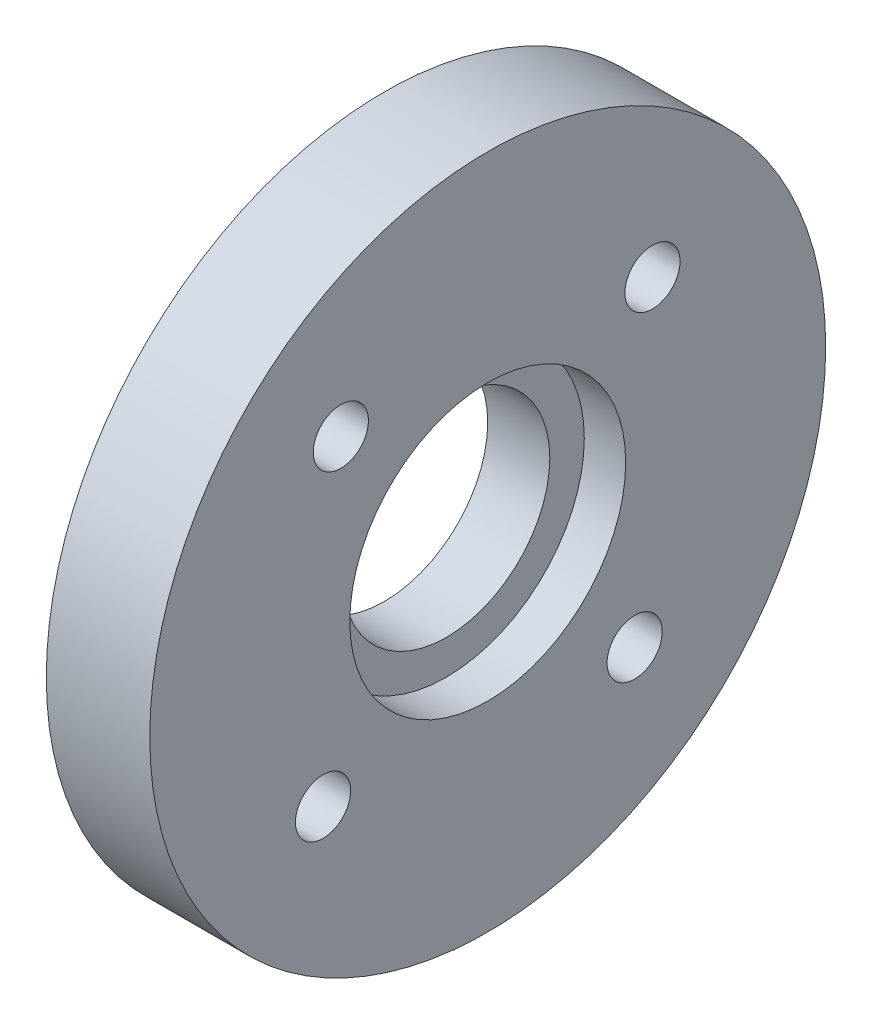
from build123d import *

# Parameters (mm, degrees)
R_P_TITION_CIRCULAIRE1_COUNT = 4


with BuildPart() as part:
    # Esquisse1 → R_volution1 (revolve)
    with BuildSketch(Plane.XY, mode=Mode.PRIVATE) as r_volution1_sk:
        Polygon((0, 49), (15, 49), (15, 20), (9, 20), (9, 15), (0, 15), align=None)
    revolve(r_volution1_sk.sketch.rotate(Axis((-6.733020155, 0, 0), (1, 0, 0)), 90), axis=Axis((-6.733020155, 0, 0), (1, 0, 0)))

    # Esquisse2 → Trou taraud_ M8x1.251 (revolve, cut)
    with BuildSketch(Plane(origin=(15, -21.29844749, 23.882548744), x_dir=(0, 0, -1), z_dir=(0, 1, 0))):
        Polygon((0, 0), (0, 25.792926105), (3.4, 23.75), (3.4, 20), (4, 20), (4, 0), align=None)
    trou_taraud_m8x1_251 = revolve(axis=Axis((21.35, -21.29844749, 23.882548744), (-1, 0, 0)), mode=Mode.SUBTRACT)

    # R_p_tition circulaire1: Trou taraud_ M8x1.251 ×4 about axis
    r_p_tition_circulaire1_axis = Axis((0, 0, 0), (1, 0, 0))
    for i in range(1, R_P_TITION_CIRCULAIRE1_COUNT):
        add(trou_taraud_m8x1_251.rotate(r_p_tition_circulaire1_axis, i * 360 / R_P_TITION_CIRCULAIRE1_COUNT), mode=Mode.SUBTRACT)


solid = part.part
